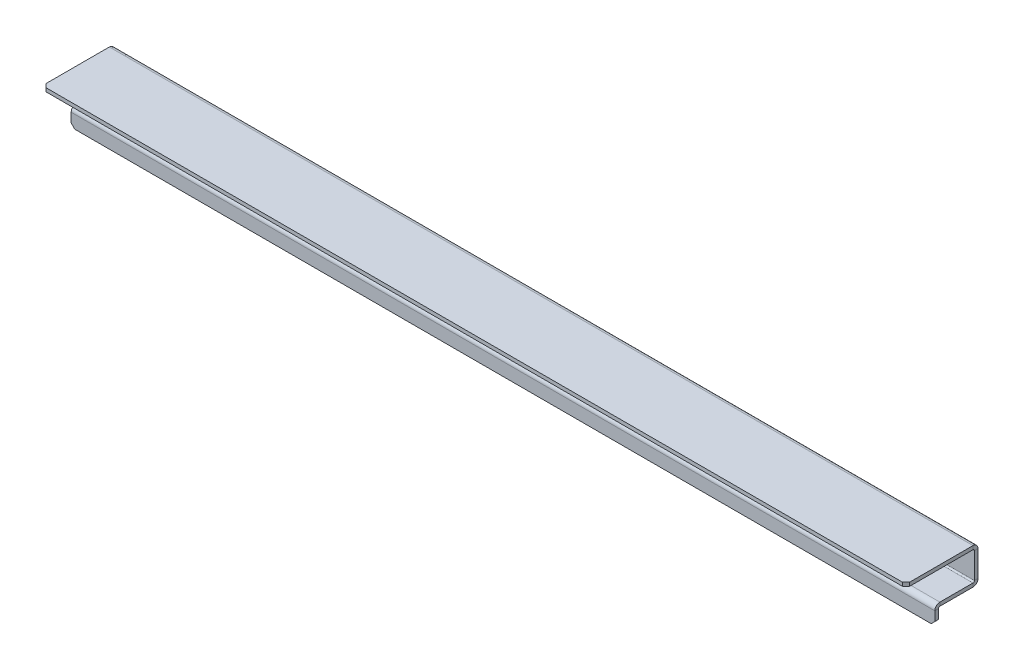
ISO-10303-21;
HEADER;
FILE_DESCRIPTION(('STEP AP214'),'2;1');
FILE_NAME('part.step','',(''),(''),'','','');
FILE_SCHEMA(('AUTOMOTIVE_DESIGN { 1 0 10303 214 1 1 1 1 }'));
ENDSEC;
DATA;
#1=APPLICATION_CONTEXT('core data for automotive mechanical design processes');
#2=APPLICATION_PROTOCOL_DEFINITION('international standard','automotive_design',2000,#1);
#3=PRODUCT_CONTEXT('',#1,'mechanical');
#4=PRODUCT('Part','Part','',(#3));
#5=PRODUCT_RELATED_PRODUCT_CATEGORY('part','',(#4));
#6=PRODUCT_DEFINITION_FORMATION('','',#4);
#7=PRODUCT_DEFINITION_CONTEXT('part definition',#1,'design');
#8=PRODUCT_DEFINITION('design','',#6,#7);
#9=PRODUCT_DEFINITION_SHAPE('','',#8);
#10=(LENGTH_UNIT() NAMED_UNIT(*) SI_UNIT(.MILLI.,.METRE.));
#11=(NAMED_UNIT(*) PLANE_ANGLE_UNIT() SI_UNIT($,.RADIAN.));
#12=(NAMED_UNIT(*) SI_UNIT($,.STERADIAN.) SOLID_ANGLE_UNIT());
#13=UNCERTAINTY_MEASURE_WITH_UNIT(LENGTH_MEASURE(1.E-05),#10,'distance_accuracy_value','');
#14=(GEOMETRIC_REPRESENTATION_CONTEXT(3) GLOBAL_UNCERTAINTY_ASSIGNED_CONTEXT((#13)) GLOBAL_UNIT_ASSIGNED_CONTEXT((#10,
#11,#12)) REPRESENTATION_CONTEXT('',''));
#15=CARTESIAN_POINT('',(0.,0.,0.));
#16=DIRECTION('',(0.,0.,1.));
#17=DIRECTION('',(1.,0.,0.));
#18=AXIS2_PLACEMENT_3D('',#15,#16,#17);
#19=CARTESIAN_POINT('',(600.,-7.,-100.));
#20=DIRECTION('',(1.,0.,0.));
#21=DIRECTION('',(0.,0.,-1.));
#22=AXIS2_PLACEMENT_3D('',#19,#20,#21);
#23=PLANE('',#22);
#24=DIRECTION('',(0.,0.,1.));
#25=VECTOR('',#24,1.);
#26=CARTESIAN_POINT('',(600.,-7.,-100.));
#27=LINE('',#26,#25);
#28=CARTESIAN_POINT('',(600.,-7.,-100.));
#29=VERTEX_POINT('',#28);
#30=CARTESIAN_POINT('',(600.,-7.,-95.));
#31=VERTEX_POINT('',#30);
#32=EDGE_CURVE('E342',#29,#31,#27,.T.);
#33=ORIENTED_EDGE('',*,*,#32,.F.);
#34=CARTESIAN_POINT('',(600.,-7.,-93.));
#35=DIRECTION('',(1.,0.,0.));
#36=DIRECTION('',(0.,0.,-1.));
#37=AXIS2_PLACEMENT_3D('',#34,#35,#36);
#38=CIRCLE('',#37,7.);
#39=CARTESIAN_POINT('',(600.,0.,-93.));
#40=VERTEX_POINT('',#39);
#41=EDGE_CURVE('E226',#40,#29,#38,.F.);
#42=ORIENTED_EDGE('',*,*,#41,.F.);
#43=DIRECTION('',(0.,1.,0.));
#44=VECTOR('',#43,1.);
#45=CARTESIAN_POINT('',(600.,-5.,-93.));
#46=LINE('',#45,#44);
#47=CARTESIAN_POINT('',(600.,-5.,-93.));
#48=VERTEX_POINT('',#47);
#49=EDGE_CURVE('E339',#48,#40,#46,.T.);
#50=ORIENTED_EDGE('',*,*,#49,.F.);
#51=CARTESIAN_POINT('',(600.,-7.,-93.));
#52=DIRECTION('',(1.,0.,0.));
#53=DIRECTION('',(0.,0.,-1.));
#54=AXIS2_PLACEMENT_3D('',#51,#52,#53);
#55=CIRCLE('',#54,2.);
#56=EDGE_CURVE('E233',#48,#31,#55,.F.);
#57=ORIENTED_EDGE('',*,*,#56,.T.);
#58=EDGE_LOOP('',(#33,#42,#50,#57));
#59=FACE_BOUND('',#58,.T.);
#60=ADVANCED_FACE('F38',(#59),#23,.T.);
#61=CARTESIAN_POINT('',(600.,-5.,-93.));
#62=DIRECTION('',(1.,0.,0.));
#63=DIRECTION('',(0.,0.,-1.));
#64=AXIS2_PLACEMENT_3D('',#61,#62,#63);
#65=PLANE('',#64);
#66=DIRECTION('',(0.,-1.,0.));
#67=VECTOR('',#66,1.);
#68=CARTESIAN_POINT('',(600.,0.,-100.));
#69=LINE('',#68,#67);
#70=CARTESIAN_POINT('',(600.,-43.,-100.));
#71=VERTEX_POINT('',#70);
#72=EDGE_CURVE('E223',#29,#71,#69,.T.);
#73=ORIENTED_EDGE('',*,*,#72,.F.);
#74=ORIENTED_EDGE('',*,*,#32,.T.);
#75=DIRECTION('',(0.,-1.,0.));
#76=VECTOR('',#75,1.);
#77=CARTESIAN_POINT('',(600.,0.,-95.));
#78=LINE('',#77,#76);
#79=CARTESIAN_POINT('',(600.,-43.,-95.));
#80=VERTEX_POINT('',#79);
#81=EDGE_CURVE('E236',#31,#80,#78,.T.);
#82=ORIENTED_EDGE('',*,*,#81,.T.);
#83=DIRECTION('',(0.,0.,-1.));
#84=VECTOR('',#83,1.);
#85=CARTESIAN_POINT('',(600.,-43.,-95.));
#86=LINE('',#85,#84);
#87=EDGE_CURVE('E330',#80,#71,#86,.T.);
#88=ORIENTED_EDGE('',*,*,#87,.T.);
#89=EDGE_LOOP('',(#73,#74,#82,#88));
#90=FACE_BOUND('',#89,.T.);
#91=ADVANCED_FACE('F409',(#90),#65,.T.);
#92=CARTESIAN_POINT('',(-600.,0.,-93.));
#93=DIRECTION('',(-1.,0.,0.));
#94=DIRECTION('',(0.,0.,1.));
#95=AXIS2_PLACEMENT_3D('',#92,#93,#94);
#96=PLANE('',#95);
#97=DIRECTION('',(0.,-1.,0.));
#98=VECTOR('',#97,1.);
#99=CARTESIAN_POINT('',(-600.,0.,-93.));
#100=LINE('',#99,#98);
#101=CARTESIAN_POINT('',(-600.,0.,-93.));
#102=VERTEX_POINT('',#101);
#103=CARTESIAN_POINT('',(-600.,-5.,-93.));
#104=VERTEX_POINT('',#103);
#105=EDGE_CURVE('E336',#102,#104,#100,.T.);
#106=ORIENTED_EDGE('',*,*,#105,.F.);
#107=CARTESIAN_POINT('',(-600.,-7.,-93.));
#108=DIRECTION('',(1.,0.,0.));
#109=DIRECTION('',(0.,0.,-1.));
#110=AXIS2_PLACEMENT_3D('',#107,#108,#109);
#111=CIRCLE('',#110,7.);
#112=CARTESIAN_POINT('',(-600.,-7.,-100.));
#113=VERTEX_POINT('',#112);
#114=EDGE_CURVE('E262',#102,#113,#111,.F.);
#115=ORIENTED_EDGE('',*,*,#114,.T.);
#116=DIRECTION('',(0.,0.,-1.));
#117=VECTOR('',#116,1.);
#118=CARTESIAN_POINT('',(-600.,-7.,-95.));
#119=LINE('',#118,#117);
#120=CARTESIAN_POINT('',(-600.,-7.,-95.));
#121=VERTEX_POINT('',#120);
#122=EDGE_CURVE('E334',#121,#113,#119,.T.);
#123=ORIENTED_EDGE('',*,*,#122,.F.);
#124=CARTESIAN_POINT('',(-600.,-7.,-93.));
#125=DIRECTION('',(1.,0.,0.));
#126=DIRECTION('',(0.,0.,-1.));
#127=AXIS2_PLACEMENT_3D('',#124,#125,#126);
#128=CIRCLE('',#127,2.);
#129=EDGE_CURVE('E269',#104,#121,#128,.F.);
#130=ORIENTED_EDGE('',*,*,#129,.F.);
#131=EDGE_LOOP('',(#106,#115,#123,#130));
#132=FACE_BOUND('',#131,.T.);
#133=ADVANCED_FACE('F390',(#132),#96,.T.);
#134=CARTESIAN_POINT('',(-600.,-7.,-95.));
#135=DIRECTION('',(-1.,0.,0.));
#136=DIRECTION('',(0.,0.,1.));
#137=AXIS2_PLACEMENT_3D('',#134,#135,#136);
#138=PLANE('',#137);
#139=DIRECTION('',(0.,0.,-1.));
#140=VECTOR('',#139,1.);
#141=CARTESIAN_POINT('',(-600.,-5.,0.));
#142=LINE('',#141,#140);
#143=CARTESIAN_POINT('',(-600.,-5.,-5.));
#144=VERTEX_POINT('',#143);
#145=EDGE_CURVE('E267',#144,#104,#142,.T.);
#146=ORIENTED_EDGE('',*,*,#145,.F.);
#147=DIRECTION('',(0.,1.,0.));
#148=VECTOR('',#147,1.);
#149=CARTESIAN_POINT('',(-600.,-7.,-5.));
#150=LINE('',#149,#148);
#151=CARTESIAN_POINT('',(-600.,0.,-5.));
#152=VERTEX_POINT('',#151);
#153=EDGE_CURVE('E370',#144,#152,#150,.T.);
#154=ORIENTED_EDGE('',*,*,#153,.T.);
#155=DIRECTION('',(0.,0.,-1.));
#156=VECTOR('',#155,1.);
#157=CARTESIAN_POINT('',(-600.,0.,0.));
#158=LINE('',#157,#156);
#159=EDGE_CURVE('E265',#152,#102,#158,.T.);
#160=ORIENTED_EDGE('',*,*,#159,.T.);
#161=ORIENTED_EDGE('',*,*,#105,.T.);
#162=EDGE_LOOP('',(#146,#154,#160,#161));
#163=FACE_BOUND('',#162,.T.);
#164=ADVANCED_FACE('F376',(#163),#138,.T.);
#165=CARTESIAN_POINT('',(600.,-50.,-93.));
#166=DIRECTION('',(1.,0.,0.));
#167=DIRECTION('',(0.,0.,-1.));
#168=AXIS2_PLACEMENT_3D('',#165,#166,#167);
#169=PLANE('',#168);
#170=DIRECTION('',(0.,1.,0.));
#171=VECTOR('',#170,1.);
#172=CARTESIAN_POINT('',(600.,-50.,-93.));
#173=LINE('',#172,#171);
#174=CARTESIAN_POINT('',(600.,-50.,-93.));
#175=VERTEX_POINT('',#174);
#176=CARTESIAN_POINT('',(600.,-45.,-93.));
#177=VERTEX_POINT('',#176);
#178=EDGE_CURVE('E332',#175,#177,#173,.T.);
#179=ORIENTED_EDGE('',*,*,#178,.F.);
#180=CARTESIAN_POINT('',(600.,-43.,-93.));
#181=DIRECTION('',(1.,0.,0.));
#182=DIRECTION('',(0.,0.,-1.));
#183=AXIS2_PLACEMENT_3D('',#180,#181,#182);
#184=CIRCLE('',#183,7.);
#185=EDGE_CURVE('E217',#71,#175,#184,.F.);
#186=ORIENTED_EDGE('',*,*,#185,.F.);
#187=ORIENTED_EDGE('',*,*,#87,.F.);
#188=CARTESIAN_POINT('',(600.,-43.,-93.));
#189=DIRECTION('',(1.,0.,0.));
#190=DIRECTION('',(0.,0.,-1.));
#191=AXIS2_PLACEMENT_3D('',#188,#189,#190);
#192=CIRCLE('',#191,2.);
#193=EDGE_CURVE('E239',#80,#177,#192,.F.);
#194=ORIENTED_EDGE('',*,*,#193,.T.);
#195=EDGE_LOOP('',(#179,#186,#187,#194));
#196=FACE_BOUND('',#195,.T.);
#197=ADVANCED_FACE('F476',(#196),#169,.T.);
#198=CARTESIAN_POINT('',(600.,-43.,-95.));
#199=DIRECTION('',(1.,0.,0.));
#200=DIRECTION('',(0.,0.,-1.));
#201=AXIS2_PLACEMENT_3D('',#198,#199,#200);
#202=PLANE('',#201);
#203=DIRECTION('',(0.,0.,1.));
#204=VECTOR('',#203,1.);
#205=CARTESIAN_POINT('',(600.,-50.,-100.));
#206=LINE('',#205,#204);
#207=CARTESIAN_POINT('',(600.,-50.,-47.));
#208=VERTEX_POINT('',#207);
#209=EDGE_CURVE('E215',#175,#208,#206,.T.);
#210=ORIENTED_EDGE('',*,*,#209,.F.);
#211=ORIENTED_EDGE('',*,*,#178,.T.);
#212=DIRECTION('',(0.,0.,1.));
#213=VECTOR('',#212,1.);
#214=CARTESIAN_POINT('',(600.,-45.,-100.));
#215=LINE('',#214,#213);
#216=CARTESIAN_POINT('',(600.,-45.,-47.));
#217=VERTEX_POINT('',#216);
#218=EDGE_CURVE('E242',#177,#217,#215,.T.);
#219=ORIENTED_EDGE('',*,*,#218,.T.);
#220=DIRECTION('',(0.,-1.,0.));
#221=VECTOR('',#220,1.);
#222=CARTESIAN_POINT('',(600.,-45.,-47.));
#223=LINE('',#222,#221);
#224=EDGE_CURVE('E188',#217,#208,#223,.T.);
#225=ORIENTED_EDGE('',*,*,#224,.T.);
#226=EDGE_LOOP('',(#210,#211,#219,#225));
#227=FACE_BOUND('',#226,.T.);
#228=ADVANCED_FACE('F472',(#227),#202,.T.);
#229=CARTESIAN_POINT('',(-600.,-43.,-100.));
#230=DIRECTION('',(-1.,0.,0.));
#231=DIRECTION('',(0.,0.,1.));
#232=AXIS2_PLACEMENT_3D('',#229,#230,#231);
#233=PLANE('',#232);
#234=DIRECTION('',(0.,0.,1.));
#235=VECTOR('',#234,1.);
#236=CARTESIAN_POINT('',(-600.,-43.,-100.));
#237=LINE('',#236,#235);
#238=CARTESIAN_POINT('',(-600.,-43.,-100.));
#239=VERTEX_POINT('',#238);
#240=CARTESIAN_POINT('',(-600.,-43.,-95.));
#241=VERTEX_POINT('',#240);
#242=EDGE_CURVE('E328',#239,#241,#237,.T.);
#243=ORIENTED_EDGE('',*,*,#242,.F.);
#244=CARTESIAN_POINT('',(-600.,-43.,-93.));
#245=DIRECTION('',(1.,0.,0.));
#246=DIRECTION('',(0.,0.,-1.));
#247=AXIS2_PLACEMENT_3D('',#244,#245,#246);
#248=CIRCLE('',#247,7.);
#249=CARTESIAN_POINT('',(-600.,-50.,-93.));
#250=VERTEX_POINT('',#249);
#251=EDGE_CURVE('E256',#239,#250,#248,.F.);
#252=ORIENTED_EDGE('',*,*,#251,.T.);
#253=DIRECTION('',(0.,-1.,0.));
#254=VECTOR('',#253,1.);
#255=CARTESIAN_POINT('',(-600.,-45.,-93.));
#256=LINE('',#255,#254);
#257=CARTESIAN_POINT('',(-600.,-45.,-93.));
#258=VERTEX_POINT('',#257);
#259=EDGE_CURVE('E187',#258,#250,#256,.T.);
#260=ORIENTED_EDGE('',*,*,#259,.F.);
#261=CARTESIAN_POINT('',(-600.,-43.,-93.));
#262=DIRECTION('',(1.,0.,0.));
#263=DIRECTION('',(0.,0.,-1.));
#264=AXIS2_PLACEMENT_3D('',#261,#262,#263);
#265=CIRCLE('',#264,2.);
#266=EDGE_CURVE('E275',#241,#258,#265,.F.);
#267=ORIENTED_EDGE('',*,*,#266,.F.);
#268=EDGE_LOOP('',(#243,#252,#260,#267));
#269=FACE_BOUND('',#268,.T.);
#270=ADVANCED_FACE('F468',(#269),#233,.T.);
#271=CARTESIAN_POINT('',(-600.,-45.,-93.));
#272=DIRECTION('',(-1.,0.,0.));
#273=DIRECTION('',(0.,0.,1.));
#274=AXIS2_PLACEMENT_3D('',#271,#272,#273);
#275=PLANE('',#274);
#276=DIRECTION('',(0.,-1.,0.));
#277=VECTOR('',#276,1.);
#278=CARTESIAN_POINT('',(-600.,0.,-100.));
#279=LINE('',#278,#277);
#280=EDGE_CURVE('E259',#113,#239,#279,.T.);
#281=ORIENTED_EDGE('',*,*,#280,.T.);
#282=ORIENTED_EDGE('',*,*,#242,.T.);
#283=DIRECTION('',(0.,-1.,0.));
#284=VECTOR('',#283,1.);
#285=CARTESIAN_POINT('',(-600.,0.,-95.));
#286=LINE('',#285,#284);
#287=EDGE_CURVE('E272',#121,#241,#286,.T.);
#288=ORIENTED_EDGE('',*,*,#287,.F.);
#289=ORIENTED_EDGE('',*,*,#122,.T.);
#290=EDGE_LOOP('',(#281,#282,#288,#289));
#291=FACE_BOUND('',#290,.T.);
#292=ADVANCED_FACE('F465',(#291),#275,.T.);
#293=CARTESIAN_POINT('',(600.,-52.,-45.));
#294=DIRECTION('',(1.,0.,0.));
#295=DIRECTION('',(0.,0.,-1.));
#296=AXIS2_PLACEMENT_3D('',#293,#294,#295);
#297=PLANE('',#296);
#298=DIRECTION('',(0.,0.,1.));
#299=VECTOR('',#298,1.);
#300=CARTESIAN_POINT('',(600.,-52.,-45.));
#301=LINE('',#300,#299);
#302=CARTESIAN_POINT('',(600.,-52.,-45.));
#303=VERTEX_POINT('',#302);
#304=CARTESIAN_POINT('',(600.,-52.,-40.));
#305=VERTEX_POINT('',#304);
#306=EDGE_CURVE('E175',#303,#305,#301,.T.);
#307=ORIENTED_EDGE('',*,*,#306,.F.);
#308=CARTESIAN_POINT('',(600.,-52.,-47.));
#309=DIRECTION('',(-1.,0.,0.));
#310=DIRECTION('',(0.,0.,1.));
#311=AXIS2_PLACEMENT_3D('',#308,#309,#310);
#312=CIRCLE('',#311,2.);
#313=EDGE_CURVE('E179',#208,#303,#312,.F.);
#314=ORIENTED_EDGE('',*,*,#313,.F.);
#315=ORIENTED_EDGE('',*,*,#224,.F.);
#316=CARTESIAN_POINT('',(600.,-52.,-47.));
#317=DIRECTION('',(1.,0.,0.));
#318=DIRECTION('',(0.,0.,-1.));
#319=AXIS2_PLACEMENT_3D('',#316,#317,#318);
#320=CIRCLE('',#319,7.);
#321=EDGE_CURVE('E182',#217,#305,#320,.T.);
#322=ORIENTED_EDGE('',*,*,#321,.T.);
#323=EDGE_LOOP('',(#307,#314,#315,#322));
#324=FACE_BOUND('',#323,.T.);
#325=ADVANCED_FACE('F177',(#324),#297,.T.);
#326=CARTESIAN_POINT('',(600.,-45.,-47.));
#327=DIRECTION('',(1.,0.,0.));
#328=DIRECTION('',(0.,0.,-1.));
#329=AXIS2_PLACEMENT_3D('',#326,#327,#328);
#330=PLANE('',#329);
#331=DIRECTION('',(0.,-1.,0.));
#332=VECTOR('',#331,1.);
#333=CARTESIAN_POINT('',(600.,-50.,-40.));
#334=LINE('',#333,#332);
#335=CARTESIAN_POINT('',(600.,-65.,-40.));
#336=VERTEX_POINT('',#335);
#337=EDGE_CURVE('E210',#305,#336,#334,.T.);
#338=ORIENTED_EDGE('',*,*,#337,.T.);
#339=DIRECTION('',(0.,0.,-1.));
#340=VECTOR('',#339,1.);
#341=CARTESIAN_POINT('',(600.,-65.,-47.));
#342=LINE('',#341,#340);
#343=CARTESIAN_POINT('',(600.,-65.,-45.));
#344=VERTEX_POINT('',#343);
#345=EDGE_CURVE('E209',#336,#344,#342,.T.);
#346=ORIENTED_EDGE('',*,*,#345,.T.);
#347=DIRECTION('',(0.,-1.,0.));
#348=VECTOR('',#347,1.);
#349=CARTESIAN_POINT('',(600.,-50.,-45.));
#350=LINE('',#349,#348);
#351=EDGE_CURVE('E197',#303,#344,#350,.T.);
#352=ORIENTED_EDGE('',*,*,#351,.F.);
#353=ORIENTED_EDGE('',*,*,#306,.T.);
#354=EDGE_LOOP('',(#338,#346,#352,#353));
#355=FACE_BOUND('',#354,.T.);
#356=ADVANCED_FACE('F207',(#355),#330,.T.);
#357=CARTESIAN_POINT('',(-600.,-50.,-47.));
#358=DIRECTION('',(-1.,0.,0.));
#359=DIRECTION('',(0.,0.,1.));
#360=AXIS2_PLACEMENT_3D('',#357,#358,#359);
#361=PLANE('',#360);
#362=DIRECTION('',(0.,1.,0.));
#363=VECTOR('',#362,1.);
#364=CARTESIAN_POINT('',(-600.,-50.,-47.));
#365=LINE('',#364,#363);
#366=CARTESIAN_POINT('',(-600.,-50.,-47.));
#367=VERTEX_POINT('',#366);
#368=CARTESIAN_POINT('',(-600.,-45.,-47.));
#369=VERTEX_POINT('',#368);
#370=EDGE_CURVE('E324',#367,#369,#365,.T.);
#371=ORIENTED_EDGE('',*,*,#370,.F.);
#372=CARTESIAN_POINT('',(-600.,-52.,-47.));
#373=DIRECTION('',(-1.,0.,0.));
#374=DIRECTION('',(0.,0.,1.));
#375=AXIS2_PLACEMENT_3D('',#372,#373,#374);
#376=CIRCLE('',#375,2.);
#377=CARTESIAN_POINT('',(-600.,-52.,-45.));
#378=VERTEX_POINT('',#377);
#379=EDGE_CURVE('E251',#367,#378,#376,.F.);
#380=ORIENTED_EDGE('',*,*,#379,.T.);
#381=DIRECTION('',(0.,0.,-1.));
#382=VECTOR('',#381,1.);
#383=CARTESIAN_POINT('',(-600.,-52.,-40.));
#384=LINE('',#383,#382);
#385=CARTESIAN_POINT('',(-600.,-52.,-40.));
#386=VERTEX_POINT('',#385);
#387=EDGE_CURVE('E322',#386,#378,#384,.T.);
#388=ORIENTED_EDGE('',*,*,#387,.F.);
#389=CARTESIAN_POINT('',(-600.,-52.,-47.));
#390=DIRECTION('',(1.,0.,0.));
#391=DIRECTION('',(0.,0.,-1.));
#392=AXIS2_PLACEMENT_3D('',#389,#390,#391);
#393=CIRCLE('',#392,7.);
#394=EDGE_CURVE('E281',#369,#386,#393,.T.);
#395=ORIENTED_EDGE('',*,*,#394,.F.);
#396=EDGE_LOOP('',(#371,#380,#388,#395));
#397=FACE_BOUND('',#396,.T.);
#398=ADVANCED_FACE('F440',(#397),#361,.T.);
#399=CARTESIAN_POINT('',(-600.,-52.,-40.));
#400=DIRECTION('',(-1.,0.,0.));
#401=DIRECTION('',(0.,0.,1.));
#402=AXIS2_PLACEMENT_3D('',#399,#400,#401);
#403=PLANE('',#402);
#404=DIRECTION('',(0.,0.,1.));
#405=VECTOR('',#404,1.);
#406=CARTESIAN_POINT('',(-600.,-50.,-100.));
#407=LINE('',#406,#405);
#408=EDGE_CURVE('E253',#250,#367,#407,.T.);
#409=ORIENTED_EDGE('',*,*,#408,.T.);
#410=ORIENTED_EDGE('',*,*,#370,.T.);
#411=DIRECTION('',(0.,0.,1.));
#412=VECTOR('',#411,1.);
#413=CARTESIAN_POINT('',(-600.,-45.,-100.));
#414=LINE('',#413,#412);
#415=EDGE_CURVE('E278',#258,#369,#414,.T.);
#416=ORIENTED_EDGE('',*,*,#415,.F.);
#417=ORIENTED_EDGE('',*,*,#259,.T.);
#418=EDGE_LOOP('',(#409,#410,#416,#417));
#419=FACE_BOUND('',#418,.T.);
#420=ADVANCED_FACE('F448',(#419),#403,.T.);
#421=CARTESIAN_POINT('',(600.,-50.,-40.));
#422=DIRECTION('',(0.,0.,-1.));
#423=DIRECTION('',(0.,1.,0.));
#424=AXIS2_PLACEMENT_3D('',#421,#422,#423);
#425=PLANE('',#424);
#426=DIRECTION('',(0.,-1.,0.));
#427=VECTOR('',#426,1.);
#428=CARTESIAN_POINT('',(-600.,-50.,-40.));
#429=LINE('',#428,#427);
#430=CARTESIAN_POINT('',(-600.,-65.,-40.));
#431=VERTEX_POINT('',#430);
#432=EDGE_CURVE('E247',#386,#431,#429,.T.);
#433=ORIENTED_EDGE('',*,*,#432,.T.);
#434=DIRECTION('',(-0.707106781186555,0.70710678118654,0.));
#435=VECTOR('',#434,1.);
#436=CARTESIAN_POINT('',(-600.,-65.,-40.));
#437=LINE('',#436,#435);
#438=CARTESIAN_POINT('',(-595.,-70.,-40.));
#439=VERTEX_POINT('',#438);
#440=EDGE_CURVE('E364',#431,#439,#437,.F.);
#441=ORIENTED_EDGE('',*,*,#440,.T.);
#442=DIRECTION('',(-1.,0.,0.));
#443=VECTOR('',#442,1.);
#444=CARTESIAN_POINT('',(600.,-70.,-40.));
#445=LINE('',#444,#443);
#446=CARTESIAN_POINT('',(595.,-70.,-40.));
#447=VERTEX_POINT('',#446);
#448=EDGE_CURVE('E319',#447,#439,#445,.T.);
#449=ORIENTED_EDGE('',*,*,#448,.F.);
#450=DIRECTION('',(-0.707106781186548,-0.707106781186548,0.));
#451=VECTOR('',#450,1.);
#452=CARTESIAN_POINT('',(595.,-70.,-40.));
#453=LINE('',#452,#451);
#454=EDGE_CURVE('E356',#447,#336,#453,.F.);
#455=ORIENTED_EDGE('',*,*,#454,.T.);
#456=ORIENTED_EDGE('',*,*,#337,.F.);
#457=DIRECTION('',(-1.,0.,0.));
#458=VECTOR('',#457,1.);
#459=CARTESIAN_POINT('',(600.,-52.,-40.));
#460=LINE('',#459,#458);
#461=EDGE_CURVE('E246',#305,#386,#460,.T.);
#462=ORIENTED_EDGE('',*,*,#461,.T.);
#463=EDGE_LOOP('',(#433,#441,#449,#455,#456,#462));
#464=FACE_BOUND('',#463,.T.);
#465=ADVANCED_FACE('F446',(#464),#425,.F.);
#466=CARTESIAN_POINT('',(600.,-70.,-45.));
#467=DIRECTION('',(0.,-1.,0.));
#468=DIRECTION('',(0.,0.,-1.));
#469=AXIS2_PLACEMENT_3D('',#466,#467,#468);
#470=PLANE('',#469);
#471=ORIENTED_EDGE('',*,*,#448,.T.);
#472=DIRECTION('',(0.,0.,-1.));
#473=VECTOR('',#472,1.);
#474=CARTESIAN_POINT('',(-595.,-70.,-45.));
#475=LINE('',#474,#473);
#476=CARTESIAN_POINT('',(-595.,-70.,-45.));
#477=VERTEX_POINT('',#476);
#478=EDGE_CURVE('E366',#439,#477,#475,.T.);
#479=ORIENTED_EDGE('',*,*,#478,.T.);
#480=DIRECTION('',(-1.,0.,0.));
#481=VECTOR('',#480,1.);
#482=CARTESIAN_POINT('',(600.,-70.,-45.));
#483=LINE('',#482,#481);
#484=CARTESIAN_POINT('',(595.,-70.,-45.));
#485=VERTEX_POINT('',#484);
#486=EDGE_CURVE('E204',#485,#477,#483,.T.);
#487=ORIENTED_EDGE('',*,*,#486,.F.);
#488=DIRECTION('',(0.,0.,1.));
#489=VECTOR('',#488,1.);
#490=CARTESIAN_POINT('',(595.,-70.,-45.));
#491=LINE('',#490,#489);
#492=EDGE_CURVE('E353',#485,#447,#491,.T.);
#493=ORIENTED_EDGE('',*,*,#492,.T.);
#494=EDGE_LOOP('',(#471,#479,#487,#493));
#495=FACE_BOUND('',#494,.T.);
#496=ADVANCED_FACE('F432',(#495),#470,.T.);
#497=CARTESIAN_POINT('',(600.,-50.,-45.));
#498=DIRECTION('',(0.,0.,-1.));
#499=DIRECTION('',(0.,1.,0.));
#500=AXIS2_PLACEMENT_3D('',#497,#498,#499);
#501=PLANE('',#500);
#502=ORIENTED_EDGE('',*,*,#486,.T.);
#503=DIRECTION('',(0.707106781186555,-0.70710678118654,0.));
#504=VECTOR('',#503,1.);
#505=CARTESIAN_POINT('',(-7.49999999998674,-657.5,-45.0000000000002));
#506=LINE('',#505,#504);
#507=CARTESIAN_POINT('',(-600.,-65.,-45.));
#508=VERTEX_POINT('',#507);
#509=EDGE_CURVE('E368',#477,#508,#506,.F.);
#510=ORIENTED_EDGE('',*,*,#509,.T.);
#511=DIRECTION('',(0.,-1.,0.));
#512=VECTOR('',#511,1.);
#513=CARTESIAN_POINT('',(-600.,-50.,-45.));
#514=LINE('',#513,#512);
#515=EDGE_CURVE('E200',#378,#508,#514,.T.);
#516=ORIENTED_EDGE('',*,*,#515,.F.);
#517=DIRECTION('',(-1.,0.,0.));
#518=VECTOR('',#517,1.);
#519=CARTESIAN_POINT('',(600.,-52.,-45.));
#520=LINE('',#519,#518);
#521=EDGE_CURVE('E194',#303,#378,#520,.T.);
#522=ORIENTED_EDGE('',*,*,#521,.F.);
#523=ORIENTED_EDGE('',*,*,#351,.T.);
#524=DIRECTION('',(0.707106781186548,0.707106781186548,0.));
#525=VECTOR('',#524,1.);
#526=CARTESIAN_POINT('',(607.5,-57.5,-45.));
#527=LINE('',#526,#525);
#528=EDGE_CURVE('E359',#344,#485,#527,.F.);
#529=ORIENTED_EDGE('',*,*,#528,.T.);
#530=EDGE_LOOP('',(#502,#510,#516,#522,#523,#529));
#531=FACE_BOUND('',#530,.T.);
#532=ADVANCED_FACE('F196',(#531),#501,.T.);
#533=CARTESIAN_POINT('',(600.,-52.,-47.));
#534=DIRECTION('',(-1.,0.,0.));
#535=DIRECTION('',(0.,0.,1.));
#536=AXIS2_PLACEMENT_3D('',#533,#534,#535);
#537=CYLINDRICAL_SURFACE('',#536,2.);
#538=ORIENTED_EDGE('',*,*,#379,.F.);
#539=DIRECTION('',(-1.,0.,0.));
#540=VECTOR('',#539,1.);
#541=CARTESIAN_POINT('',(600.,-50.,-47.));
#542=LINE('',#541,#540);
#543=EDGE_CURVE('E205',#208,#367,#542,.T.);
#544=ORIENTED_EDGE('',*,*,#543,.F.);
#545=ORIENTED_EDGE('',*,*,#313,.T.);
#546=ORIENTED_EDGE('',*,*,#521,.T.);
#547=EDGE_LOOP('',(#538,#544,#545,#546));
#548=FACE_BOUND('',#547,.T.);
#549=ADVANCED_FACE('F213',(#548),#537,.F.);
#550=CARTESIAN_POINT('',(600.,-50.,-100.));
#551=DIRECTION('',(0.,-1.,0.));
#552=DIRECTION('',(0.,0.,-1.));
#553=AXIS2_PLACEMENT_3D('',#550,#551,#552);
#554=PLANE('',#553);
#555=ORIENTED_EDGE('',*,*,#408,.F.);
#556=DIRECTION('',(-1.,0.,0.));
#557=VECTOR('',#556,1.);
#558=CARTESIAN_POINT('',(600.,-50.,-93.));
#559=LINE('',#558,#557);
#560=EDGE_CURVE('E314',#175,#250,#559,.T.);
#561=ORIENTED_EDGE('',*,*,#560,.F.);
#562=ORIENTED_EDGE('',*,*,#209,.T.);
#563=ORIENTED_EDGE('',*,*,#543,.T.);
#564=EDGE_LOOP('',(#555,#561,#562,#563));
#565=FACE_BOUND('',#564,.T.);
#566=ADVANCED_FACE('F535',(#565),#554,.T.);
#567=CARTESIAN_POINT('',(600.,-43.,-93.));
#568=DIRECTION('',(-1.,0.,0.));
#569=DIRECTION('',(0.,0.,1.));
#570=AXIS2_PLACEMENT_3D('',#567,#568,#569);
#571=CYLINDRICAL_SURFACE('',#570,7.);
#572=ORIENTED_EDGE('',*,*,#251,.F.);
#573=DIRECTION('',(-1.,0.,0.));
#574=VECTOR('',#573,1.);
#575=CARTESIAN_POINT('',(600.,-43.,-100.));
#576=LINE('',#575,#574);
#577=EDGE_CURVE('E311',#71,#239,#576,.T.);
#578=ORIENTED_EDGE('',*,*,#577,.F.);
#579=ORIENTED_EDGE('',*,*,#185,.T.);
#580=ORIENTED_EDGE('',*,*,#560,.T.);
#581=EDGE_LOOP('',(#572,#578,#579,#580));
#582=FACE_BOUND('',#581,.T.);
#583=ADVANCED_FACE('F547',(#582),#571,.T.);
#584=CARTESIAN_POINT('',(600.,0.,-100.));
#585=DIRECTION('',(0.,0.,-1.));
#586=DIRECTION('',(0.,1.,0.));
#587=AXIS2_PLACEMENT_3D('',#584,#585,#586);
#588=PLANE('',#587);
#589=ORIENTED_EDGE('',*,*,#280,.F.);
#590=DIRECTION('',(-1.,0.,0.));
#591=VECTOR('',#590,1.);
#592=CARTESIAN_POINT('',(600.,-7.,-100.));
#593=LINE('',#592,#591);
#594=EDGE_CURVE('E308',#29,#113,#593,.T.);
#595=ORIENTED_EDGE('',*,*,#594,.F.);
#596=ORIENTED_EDGE('',*,*,#72,.T.);
#597=ORIENTED_EDGE('',*,*,#577,.T.);
#598=EDGE_LOOP('',(#589,#595,#596,#597));
#599=FACE_BOUND('',#598,.T.);
#600=ADVANCED_FACE('F558',(#599),#588,.T.);
#601=CARTESIAN_POINT('',(600.,-7.,-93.));
#602=DIRECTION('',(-1.,0.,0.));
#603=DIRECTION('',(0.,0.,1.));
#604=AXIS2_PLACEMENT_3D('',#601,#602,#603);
#605=CYLINDRICAL_SURFACE('',#604,7.);
#606=ORIENTED_EDGE('',*,*,#114,.F.);
#607=DIRECTION('',(-1.,0.,0.));
#608=VECTOR('',#607,1.);
#609=CARTESIAN_POINT('',(600.,0.,-93.));
#610=LINE('',#609,#608);
#611=EDGE_CURVE('E305',#40,#102,#610,.T.);
#612=ORIENTED_EDGE('',*,*,#611,.F.);
#613=ORIENTED_EDGE('',*,*,#41,.T.);
#614=ORIENTED_EDGE('',*,*,#594,.T.);
#615=EDGE_LOOP('',(#606,#612,#613,#614));
#616=FACE_BOUND('',#615,.T.);
#617=ADVANCED_FACE('F386',(#616),#605,.T.);
#618=CARTESIAN_POINT('',(600.,0.,0.));
#619=DIRECTION('',(0.,1.,0.));
#620=DIRECTION('',(0.,0.,1.));
#621=AXIS2_PLACEMENT_3D('',#618,#619,#620);
#622=PLANE('',#621);
#623=ORIENTED_EDGE('',*,*,#159,.F.);
#624=DIRECTION('',(-0.707106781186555,0.,-0.70710678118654));
#625=VECTOR('',#624,1.);
#626=CARTESIAN_POINT('',(2.50000000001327,0.,597.5));
#627=LINE('',#626,#625);
#628=CARTESIAN_POINT('',(-595.,0.,0.));
#629=VERTEX_POINT('',#628);
#630=EDGE_CURVE('E60',#152,#629,#627,.F.);
#631=ORIENTED_EDGE('',*,*,#630,.T.);
#632=DIRECTION('',(-1.,0.,0.));
#633=VECTOR('',#632,1.);
#634=CARTESIAN_POINT('',(600.,0.,0.));
#635=LINE('',#634,#633);
#636=CARTESIAN_POINT('',(595.,0.,0.));
#637=VERTEX_POINT('',#636);
#638=EDGE_CURVE('E303',#637,#629,#635,.T.);
#639=ORIENTED_EDGE('',*,*,#638,.F.);
#640=DIRECTION('',(0.707106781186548,0.,-0.707106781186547));
#641=VECTOR('',#640,1.);
#642=CARTESIAN_POINT('',(597.5,0.,-2.5));
#643=LINE('',#642,#641);
#644=CARTESIAN_POINT('',(600.,0.,-5.));
#645=VERTEX_POINT('',#644);
#646=EDGE_CURVE('E347',#637,#645,#643,.T.);
#647=ORIENTED_EDGE('',*,*,#646,.T.);
#648=DIRECTION('',(0.,0.,-1.));
#649=VECTOR('',#648,1.);
#650=CARTESIAN_POINT('',(600.,0.,0.));
#651=LINE('',#650,#649);
#652=EDGE_CURVE('E229',#645,#40,#651,.T.);
#653=ORIENTED_EDGE('',*,*,#652,.T.);
#654=ORIENTED_EDGE('',*,*,#611,.T.);
#655=EDGE_LOOP('',(#623,#631,#639,#647,#653,#654));
#656=FACE_BOUND('',#655,.T.);
#657=ADVANCED_FACE('F380',(#656),#622,.T.);
#658=CARTESIAN_POINT('',(600.,-5.,0.));
#659=DIRECTION('',(0.,0.,1.));
#660=DIRECTION('',(1.,0.,0.));
#661=AXIS2_PLACEMENT_3D('',#658,#659,#660);
#662=PLANE('',#661);
#663=ORIENTED_EDGE('',*,*,#638,.T.);
#664=DIRECTION('',(0.,-1.,0.));
#665=VECTOR('',#664,1.);
#666=CARTESIAN_POINT('',(-595.,-5.,0.));
#667=LINE('',#666,#665);
#668=CARTESIAN_POINT('',(-595.,-5.,0.));
#669=VERTEX_POINT('',#668);
#670=EDGE_CURVE('E46',#629,#669,#667,.T.);
#671=ORIENTED_EDGE('',*,*,#670,.T.);
#672=DIRECTION('',(-1.,0.,0.));
#673=VECTOR('',#672,1.);
#674=CARTESIAN_POINT('',(600.,-5.,0.));
#675=LINE('',#674,#673);
#676=CARTESIAN_POINT('',(595.,-5.,0.));
#677=VERTEX_POINT('',#676);
#678=EDGE_CURVE('E301',#677,#669,#675,.T.);
#679=ORIENTED_EDGE('',*,*,#678,.F.);
#680=DIRECTION('',(0.,1.,0.));
#681=VECTOR('',#680,1.);
#682=CARTESIAN_POINT('',(595.,0.,0.));
#683=LINE('',#682,#681);
#684=EDGE_CURVE('E344',#677,#637,#683,.T.);
#685=ORIENTED_EDGE('',*,*,#684,.T.);
#686=EDGE_LOOP('',(#663,#671,#679,#685));
#687=FACE_BOUND('',#686,.T.);
#688=ADVANCED_FACE('F725',(#687),#662,.T.);
#689=CARTESIAN_POINT('',(600.,-5.,0.));
#690=DIRECTION('',(0.,1.,0.));
#691=DIRECTION('',(0.,0.,1.));
#692=AXIS2_PLACEMENT_3D('',#689,#690,#691);
#693=PLANE('',#692);
#694=ORIENTED_EDGE('',*,*,#678,.T.);
#695=DIRECTION('',(0.707106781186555,0.,0.70710678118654));
#696=VECTOR('',#695,1.);
#697=CARTESIAN_POINT('',(-600.,-5.,-5.));
#698=LINE('',#697,#696);
#699=EDGE_CURVE('E11',#669,#144,#698,.F.);
#700=ORIENTED_EDGE('',*,*,#699,.T.);
#701=ORIENTED_EDGE('',*,*,#145,.T.);
#702=DIRECTION('',(-1.,0.,0.));
#703=VECTOR('',#702,1.);
#704=CARTESIAN_POINT('',(600.,-5.,-93.));
#705=LINE('',#704,#703);
#706=EDGE_CURVE('E298',#48,#104,#705,.T.);
#707=ORIENTED_EDGE('',*,*,#706,.F.);
#708=DIRECTION('',(0.,0.,-1.));
#709=VECTOR('',#708,1.);
#710=CARTESIAN_POINT('',(600.,-5.,0.));
#711=LINE('',#710,#709);
#712=CARTESIAN_POINT('',(600.,-5.,-5.));
#713=VERTEX_POINT('',#712);
#714=EDGE_CURVE('E231',#713,#48,#711,.T.);
#715=ORIENTED_EDGE('',*,*,#714,.F.);
#716=DIRECTION('',(-0.707106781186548,0.,0.707106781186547));
#717=VECTOR('',#716,1.);
#718=CARTESIAN_POINT('',(595.,-5.,0.));
#719=LINE('',#718,#717);
#720=EDGE_CURVE('E351',#713,#677,#719,.T.);
#721=ORIENTED_EDGE('',*,*,#720,.T.);
#722=EDGE_LOOP('',(#694,#700,#701,#707,#715,#721));
#723=FACE_BOUND('',#722,.T.);
#724=ADVANCED_FACE('F399',(#723),#693,.F.);
#725=CARTESIAN_POINT('',(600.,-7.,-93.));
#726=DIRECTION('',(-1.,0.,0.));
#727=DIRECTION('',(0.,0.,1.));
#728=AXIS2_PLACEMENT_3D('',#725,#726,#727);
#729=CYLINDRICAL_SURFACE('',#728,2.);
#730=ORIENTED_EDGE('',*,*,#129,.T.);
#731=DIRECTION('',(-1.,0.,0.));
#732=VECTOR('',#731,1.);
#733=CARTESIAN_POINT('',(600.,-7.,-95.));
#734=LINE('',#733,#732);
#735=EDGE_CURVE('E295',#31,#121,#734,.T.);
#736=ORIENTED_EDGE('',*,*,#735,.F.);
#737=ORIENTED_EDGE('',*,*,#56,.F.);
#738=ORIENTED_EDGE('',*,*,#706,.T.);
#739=EDGE_LOOP('',(#730,#736,#737,#738));
#740=FACE_BOUND('',#739,.T.);
#741=ADVANCED_FACE('F395',(#740),#729,.F.);
#742=CARTESIAN_POINT('',(600.,0.,-95.));
#743=DIRECTION('',(0.,0.,-1.));
#744=DIRECTION('',(0.,1.,0.));
#745=AXIS2_PLACEMENT_3D('',#742,#743,#744);
#746=PLANE('',#745);
#747=ORIENTED_EDGE('',*,*,#287,.T.);
#748=DIRECTION('',(-1.,0.,0.));
#749=VECTOR('',#748,1.);
#750=CARTESIAN_POINT('',(600.,-43.,-95.));
#751=LINE('',#750,#749);
#752=EDGE_CURVE('E292',#80,#241,#751,.T.);
#753=ORIENTED_EDGE('',*,*,#752,.F.);
#754=ORIENTED_EDGE('',*,*,#81,.F.);
#755=ORIENTED_EDGE('',*,*,#735,.T.);
#756=EDGE_LOOP('',(#747,#753,#754,#755));
#757=FACE_BOUND('',#756,.T.);
#758=ADVANCED_FACE('F590',(#757),#746,.F.);
#759=CARTESIAN_POINT('',(600.,-43.,-93.));
#760=DIRECTION('',(-1.,0.,0.));
#761=DIRECTION('',(0.,0.,1.));
#762=AXIS2_PLACEMENT_3D('',#759,#760,#761);
#763=CYLINDRICAL_SURFACE('',#762,2.);
#764=ORIENTED_EDGE('',*,*,#266,.T.);
#765=DIRECTION('',(-1.,0.,0.));
#766=VECTOR('',#765,1.);
#767=CARTESIAN_POINT('',(600.,-45.,-93.));
#768=LINE('',#767,#766);
#769=EDGE_CURVE('E289',#177,#258,#768,.T.);
#770=ORIENTED_EDGE('',*,*,#769,.F.);
#771=ORIENTED_EDGE('',*,*,#193,.F.);
#772=ORIENTED_EDGE('',*,*,#752,.T.);
#773=EDGE_LOOP('',(#764,#770,#771,#772));
#774=FACE_BOUND('',#773,.T.);
#775=ADVANCED_FACE('F602',(#774),#763,.F.);
#776=CARTESIAN_POINT('',(600.,-45.,-100.));
#777=DIRECTION('',(0.,-1.,0.));
#778=DIRECTION('',(0.,0.,-1.));
#779=AXIS2_PLACEMENT_3D('',#776,#777,#778);
#780=PLANE('',#779);
#781=ORIENTED_EDGE('',*,*,#415,.T.);
#782=DIRECTION('',(-1.,0.,0.));
#783=VECTOR('',#782,1.);
#784=CARTESIAN_POINT('',(600.,-45.,-47.));
#785=LINE('',#784,#783);
#786=EDGE_CURVE('E286',#217,#369,#785,.T.);
#787=ORIENTED_EDGE('',*,*,#786,.F.);
#788=ORIENTED_EDGE('',*,*,#218,.F.);
#789=ORIENTED_EDGE('',*,*,#769,.T.);
#790=EDGE_LOOP('',(#781,#787,#788,#789));
#791=FACE_BOUND('',#790,.T.);
#792=ADVANCED_FACE('F613',(#791),#780,.F.);
#793=CARTESIAN_POINT('',(600.,-52.,-47.));
#794=DIRECTION('',(-1.,0.,0.));
#795=DIRECTION('',(0.,0.,1.));
#796=AXIS2_PLACEMENT_3D('',#793,#794,#795);
#797=CYLINDRICAL_SURFACE('',#796,7.);
#798=ORIENTED_EDGE('',*,*,#394,.T.);
#799=ORIENTED_EDGE('',*,*,#461,.F.);
#800=ORIENTED_EDGE('',*,*,#321,.F.);
#801=ORIENTED_EDGE('',*,*,#786,.T.);
#802=EDGE_LOOP('',(#798,#799,#800,#801));
#803=FACE_BOUND('',#802,.T.);
#804=ADVANCED_FACE('F442',(#803),#797,.T.);
#805=CARTESIAN_POINT('',(600.,-52.,-47.));
#806=DIRECTION('',(-1.,0.,0.));
#807=DIRECTION('',(0.,0.,1.));
#808=AXIS2_PLACEMENT_3D('',#805,#806,#807);
#809=PLANE('',#808);
#810=ORIENTED_EDGE('',*,*,#652,.F.);
#811=DIRECTION('',(0.,-1.,0.));
#812=VECTOR('',#811,1.);
#813=CARTESIAN_POINT('',(600.,-5.,-5.));
#814=LINE('',#813,#812);
#815=EDGE_CURVE('E349',#645,#713,#814,.T.);
#816=ORIENTED_EDGE('',*,*,#815,.T.);
#817=ORIENTED_EDGE('',*,*,#714,.T.);
#818=ORIENTED_EDGE('',*,*,#49,.T.);
#819=EDGE_LOOP('',(#810,#816,#817,#818));
#820=FACE_BOUND('',#819,.T.);
#821=ADVANCED_FACE('F632',(#820),#809,.F.);
#822=CARTESIAN_POINT('',(-600.,-52.,-47.));
#823=DIRECTION('',(-1.,0.,0.));
#824=DIRECTION('',(0.,0.,1.));
#825=AXIS2_PLACEMENT_3D('',#822,#823,#824);
#826=PLANE('',#825);
#827=ORIENTED_EDGE('',*,*,#515,.T.);
#828=DIRECTION('',(0.,0.,1.));
#829=VECTOR('',#828,1.);
#830=CARTESIAN_POINT('',(-600.,-65.,-47.));
#831=LINE('',#830,#829);
#832=EDGE_CURVE('E361',#508,#431,#831,.T.);
#833=ORIENTED_EDGE('',*,*,#832,.T.);
#834=ORIENTED_EDGE('',*,*,#432,.F.);
#835=ORIENTED_EDGE('',*,*,#387,.T.);
#836=EDGE_LOOP('',(#827,#833,#834,#835));
#837=FACE_BOUND('',#836,.T.);
#838=ADVANCED_FACE('F422',(#837),#826,.T.);
#839=CARTESIAN_POINT('',(595.,-5.,0.));
#840=DIRECTION('',(0.707106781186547,0.,0.707106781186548));
#841=DIRECTION('',(0.707106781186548,0.,-0.707106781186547));
#842=AXIS2_PLACEMENT_3D('',#839,#840,#841);
#843=PLANE('',#842);
#844=ORIENTED_EDGE('',*,*,#720,.F.);
#845=ORIENTED_EDGE('',*,*,#815,.F.);
#846=ORIENTED_EDGE('',*,*,#646,.F.);
#847=ORIENTED_EDGE('',*,*,#684,.F.);
#848=EDGE_LOOP('',(#844,#845,#846,#847));
#849=FACE_BOUND('',#848,.T.);
#850=ADVANCED_FACE('F419',(#849),#843,.T.);
#851=CARTESIAN_POINT('',(595.,-70.,-45.));
#852=DIRECTION('',(-0.707106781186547,0.707106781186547,0.));
#853=DIRECTION('',(-0.707106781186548,-0.707106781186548,0.));
#854=AXIS2_PLACEMENT_3D('',#851,#852,#853);
#855=PLANE('',#854);
#856=ORIENTED_EDGE('',*,*,#528,.F.);
#857=ORIENTED_EDGE('',*,*,#345,.F.);
#858=ORIENTED_EDGE('',*,*,#454,.F.);
#859=ORIENTED_EDGE('',*,*,#492,.F.);
#860=EDGE_LOOP('',(#856,#857,#858,#859));
#861=FACE_BOUND('',#860,.T.);
#862=ADVANCED_FACE('F406',(#861),#855,.F.);
#863=CARTESIAN_POINT('',(-600.,-65.,-47.));
#864=DIRECTION('',(0.70710678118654,0.707106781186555,0.));
#865=DIRECTION('',(-0.707106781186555,0.70710678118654,0.));
#866=AXIS2_PLACEMENT_3D('',#863,#864,#865);
#867=PLANE('',#866);
#868=ORIENTED_EDGE('',*,*,#509,.F.);
#869=ORIENTED_EDGE('',*,*,#478,.F.);
#870=ORIENTED_EDGE('',*,*,#440,.F.);
#871=ORIENTED_EDGE('',*,*,#832,.F.);
#872=EDGE_LOOP('',(#868,#869,#870,#871));
#873=FACE_BOUND('',#872,.T.);
#874=ADVANCED_FACE('F402',(#873),#867,.F.);
#875=CARTESIAN_POINT('',(-600.,-7.,-5.));
#876=DIRECTION('',(0.70710678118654,0.,-0.707106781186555));
#877=DIRECTION('',(-0.707106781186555,0.,-0.70710678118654));
#878=AXIS2_PLACEMENT_3D('',#875,#876,#877);
#879=PLANE('',#878);
#880=ORIENTED_EDGE('',*,*,#699,.F.);
#881=ORIENTED_EDGE('',*,*,#670,.F.);
#882=ORIENTED_EDGE('',*,*,#630,.F.);
#883=ORIENTED_EDGE('',*,*,#153,.F.);
#884=EDGE_LOOP('',(#880,#881,#882,#883));
#885=FACE_BOUND('',#884,.T.);
#886=ADVANCED_FACE('F40',(#885),#879,.F.);
#887=CLOSED_SHELL('',(#60,#91,#133,#164,#197,#228,#270,#292,#325,#356,#398,#420,#465,#496,#532,
#549,#566,#583,#600,#617,#657,#688,#724,#741,#758,#775,#792,#804,#821,#838,#850,#862,#874,#886));
#888=MANIFOLD_SOLID_BREP('B2',#887);
#889=ADVANCED_BREP_SHAPE_REPRESENTATION('',(#18,#888),#14);
#890=SHAPE_DEFINITION_REPRESENTATION(#9,#889);
ENDSEC;
END-ISO-10303-21;
